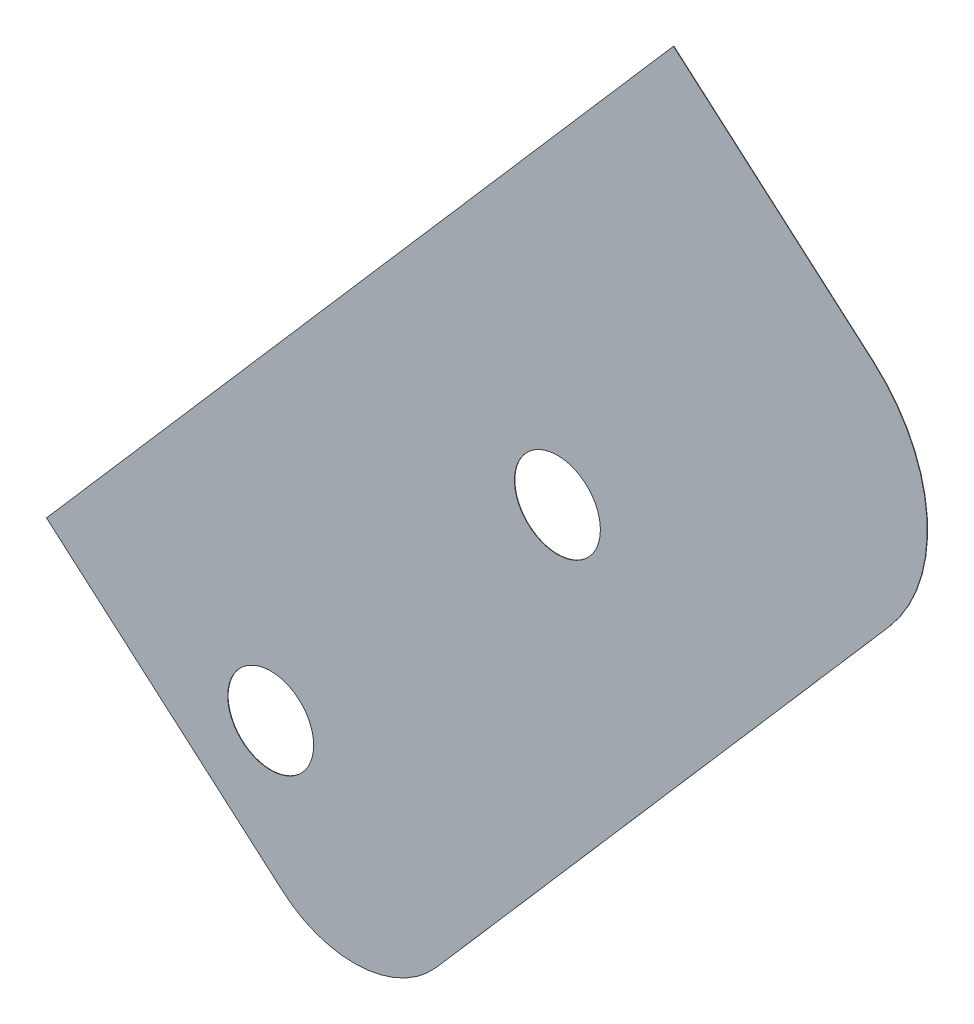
from build123d import *

# Parameters (mm, degrees)
BOSS_EXTRUDE1_DEPTH = 0.0254
HOLE1_D             = 5.6134


with BuildPart() as part:
    # Sketch1 → Boss-Extrude1 (new body)
    with BuildSketch(Plane.XY):
        with BuildLine():
            Line((-621.950540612, -66.44465209), (-634.991420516, -55.119572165))
            Line((-634.991420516, -55.119572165), (-675.961562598, -102.296872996))
            Line((-675.961562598, -102.296872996), (-660.523462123, -115.703769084))
            ThreePointArc((-660.523462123, -115.703769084), (-655.360618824, -117.42842724), (-650.49041984, -114.99726321))
            Line((-650.49041984, -114.99726321), (-620.92863033, -80.956731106))
            ThreePointArc((-620.92863033, -80.956731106), (-618.434035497, -73.489047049), (-621.950540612, -66.44465209))
        make_face()
    extrude(amount=BOSS_EXTRUDE1_DEPTH)

    # Hole1 (through all)
    with Locations(Plane(origin=(-664.964981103, -95.840484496, 0.0254), x_dir=(1, 0, 0), z_dir=(0, 0, 1))):
        with Locations((3.654260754, -10.601140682), (22.390606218, 10.973844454)):
            Hole(HOLE1_D / 2)


solid = part.part
